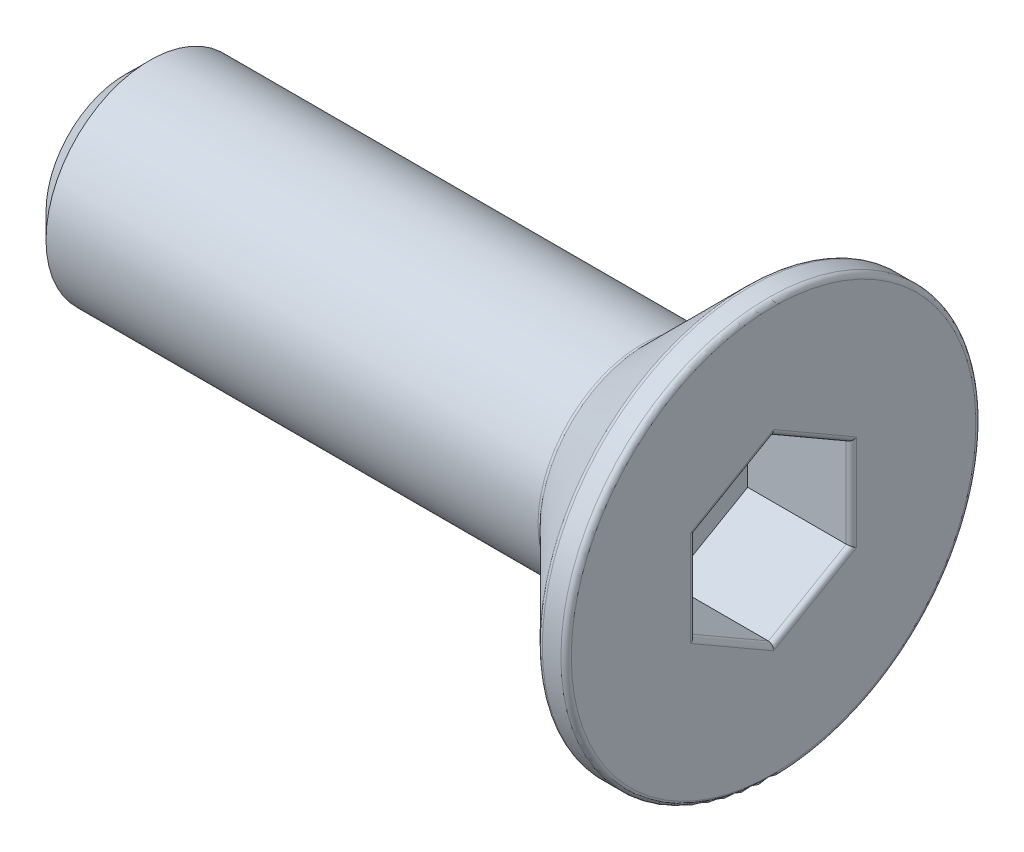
ISO-10303-21;
HEADER;
FILE_DESCRIPTION(('STEP AP214'),'2;1');
FILE_NAME('part.step','',(''),(''),'','','');
FILE_SCHEMA(('AUTOMOTIVE_DESIGN { 1 0 10303 214 1 1 1 1 }'));
ENDSEC;
DATA;
#1=APPLICATION_CONTEXT('core data for automotive mechanical design processes');
#2=APPLICATION_PROTOCOL_DEFINITION('international standard','automotive_design',2000,#1);
#3=PRODUCT_CONTEXT('',#1,'mechanical');
#4=PRODUCT('Part','Part','',(#3));
#5=PRODUCT_RELATED_PRODUCT_CATEGORY('part','',(#4));
#6=PRODUCT_DEFINITION_FORMATION('','',#4);
#7=PRODUCT_DEFINITION_CONTEXT('part definition',#1,'design');
#8=PRODUCT_DEFINITION('design','',#6,#7);
#9=PRODUCT_DEFINITION_SHAPE('','',#8);
#10=(LENGTH_UNIT() NAMED_UNIT(*) SI_UNIT(.MILLI.,.METRE.));
#11=(NAMED_UNIT(*) PLANE_ANGLE_UNIT() SI_UNIT($,.RADIAN.));
#12=(NAMED_UNIT(*) SI_UNIT($,.STERADIAN.) SOLID_ANGLE_UNIT());
#13=UNCERTAINTY_MEASURE_WITH_UNIT(LENGTH_MEASURE(1.E-05),#10,'distance_accuracy_value','');
#14=(GEOMETRIC_REPRESENTATION_CONTEXT(3) GLOBAL_UNCERTAINTY_ASSIGNED_CONTEXT((#13)) GLOBAL_UNIT_ASSIGNED_CONTEXT((#10,
#11,#12)) REPRESENTATION_CONTEXT('',''));
#15=CARTESIAN_POINT('',(0.,0.,0.));
#16=DIRECTION('',(0.,0.,1.));
#17=DIRECTION('',(1.,0.,0.));
#18=AXIS2_PLACEMENT_3D('',#15,#16,#17);
#19=CARTESIAN_POINT('',(0.,0.,0.));
#20=DIRECTION('',(-1.,0.,0.));
#21=DIRECTION('',(0.,0.,1.));
#22=AXIS2_PLACEMENT_3D('',#19,#20,#21);
#23=CYLINDRICAL_SURFACE('',#22,2.);
#24=CARTESIAN_POINT('',(13.9585786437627,0.,0.));
#25=DIRECTION('',(-1.,0.,0.));
#26=DIRECTION('',(0.,0.,1.));
#27=AXIS2_PLACEMENT_3D('',#24,#25,#26);
#28=CIRCLE('',#27,2.);
#29=CARTESIAN_POINT('',(13.9585786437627,0.,2.));
#30=VERTEX_POINT('',#29);
#31=EDGE_CURVE('E161',#30,#30,#28,.T.);
#32=ORIENTED_EDGE('',*,*,#31,.T.);
#33=EDGE_LOOP('',(#32));
#34=FACE_BOUND('',#33,.T.);
#35=CARTESIAN_POINT('',(4.47361785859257,0.,0.));
#36=DIRECTION('',(1.,0.,0.));
#37=DIRECTION('',(0.,0.,-1.));
#38=AXIS2_PLACEMENT_3D('',#35,#36,#37);
#39=CIRCLE('',#38,2.);
#40=CARTESIAN_POINT('',(4.47361785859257,0.,-2.));
#41=VERTEX_POINT('',#40);
#42=EDGE_CURVE('E123',#41,#41,#39,.F.);
#43=ORIENTED_EDGE('',*,*,#42,.F.);
#44=EDGE_LOOP('',(#43));
#45=FACE_BOUND('',#44,.T.);
#46=ADVANCED_FACE('F33',(#34,#45),#23,.T.);
#47=CARTESIAN_POINT('',(16.,0.,0.));
#48=DIRECTION('',(1.,0.,0.));
#49=DIRECTION('',(0.,0.,-1.));
#50=AXIS2_PLACEMENT_3D('',#47,#48,#49);
#51=CONICAL_SURFACE('',#50,4.,0.78539816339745);
#52=CARTESIAN_POINT('',(15.9707106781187,0.,0.));
#53=DIRECTION('',(-1.,0.,0.));
#54=DIRECTION('',(0.,0.,1.));
#55=AXIS2_PLACEMENT_3D('',#52,#53,#54);
#56=CIRCLE('',#55,3.97071067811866);
#57=CARTESIAN_POINT('',(15.9707106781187,0.,3.97071067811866));
#58=VERTEX_POINT('',#57);
#59=EDGE_CURVE('E152',#58,#58,#56,.T.);
#60=ORIENTED_EDGE('',*,*,#59,.T.);
#61=EDGE_LOOP('',(#60));
#62=FACE_BOUND('',#61,.T.);
#63=CARTESIAN_POINT('',(14.0292893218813,0.,0.));
#64=DIRECTION('',(1.,0.,0.));
#65=DIRECTION('',(0.,0.,-1.));
#66=AXIS2_PLACEMENT_3D('',#63,#64,#65);
#67=CIRCLE('',#66,2.02928932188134);
#68=CARTESIAN_POINT('',(14.0292893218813,0.,-2.02928932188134));
#69=VERTEX_POINT('',#68);
#70=EDGE_CURVE('E140',#69,#69,#67,.T.);
#71=ORIENTED_EDGE('',*,*,#70,.T.);
#72=EDGE_LOOP('',(#71));
#73=FACE_BOUND('',#72,.T.);
#74=ADVANCED_FACE('F240',(#62,#73),#51,.T.);
#75=CARTESIAN_POINT('',(0.,0.,0.));
#76=DIRECTION('',(-1.,0.,0.));
#77=DIRECTION('',(0.,0.,1.));
#78=AXIS2_PLACEMENT_3D('',#75,#76,#77);
#79=CYLINDRICAL_SURFACE('',#78,4.);
#80=CARTESIAN_POINT('',(16.0414213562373,0.,0.));
#81=DIRECTION('',(1.,0.,0.));
#82=DIRECTION('',(0.,0.,-1.));
#83=AXIS2_PLACEMENT_3D('',#80,#81,#82);
#84=CIRCLE('',#83,4.);
#85=CARTESIAN_POINT('',(16.0414213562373,0.,-4.));
#86=VERTEX_POINT('',#85);
#87=EDGE_CURVE('E158',#86,#86,#84,.T.);
#88=ORIENTED_EDGE('',*,*,#87,.T.);
#89=EDGE_LOOP('',(#88));
#90=FACE_BOUND('',#89,.T.);
#91=CARTESIAN_POINT('',(16.4,0.,0.));
#92=DIRECTION('',(-1.,0.,0.));
#93=DIRECTION('',(0.,0.,1.));
#94=AXIS2_PLACEMENT_3D('',#91,#92,#93);
#95=CIRCLE('',#94,4.);
#96=CARTESIAN_POINT('',(16.4,0.,4.));
#97=VERTEX_POINT('',#96);
#98=EDGE_CURVE('E155',#97,#97,#95,.T.);
#99=ORIENTED_EDGE('',*,*,#98,.T.);
#100=EDGE_LOOP('',(#99));
#101=FACE_BOUND('',#100,.T.);
#102=ADVANCED_FACE('F245',(#90,#101),#79,.T.);
#103=CARTESIAN_POINT('',(16.5,4.,0.));
#104=DIRECTION('',(-1.,0.,0.));
#105=DIRECTION('',(0.,0.,1.));
#106=AXIS2_PLACEMENT_3D('',#103,#104,#105);
#107=PLANE('',#106);
#108=CARTESIAN_POINT('',(16.5,0.,0.));
#109=DIRECTION('',(-1.,0.,0.));
#110=DIRECTION('',(0.,0.,1.));
#111=AXIS2_PLACEMENT_3D('',#108,#109,#110);
#112=CIRCLE('',#111,3.9);
#113=CARTESIAN_POINT('',(16.5,0.,3.9));
#114=VERTEX_POINT('',#113);
#115=EDGE_CURVE('E177',#114,#114,#112,.F.);
#116=ORIENTED_EDGE('',*,*,#115,.T.);
#117=EDGE_LOOP('',(#116));
#118=FACE_BOUND('',#117,.T.);
#119=DIRECTION('',(0.,0.5,0.866025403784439));
#120=VECTOR('',#119,1.);
#121=CARTESIAN_POINT('',(16.5,2.3856406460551,0.932050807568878));
#122=LINE('',#121,#120);
#123=CARTESIAN_POINT('',(16.5,1.8475208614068,0.));
#124=VERTEX_POINT('',#123);
#125=CARTESIAN_POINT('',(16.5,0.923760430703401,-1.6));
#126=VERTEX_POINT('',#125);
#127=EDGE_CURVE('E172',#124,#126,#122,.F.);
#128=ORIENTED_EDGE('',*,*,#127,.T.);
#129=DIRECTION('',(0.,1.,0.));
#130=VECTOR('',#129,1.);
#131=CARTESIAN_POINT('',(16.5,4.,-1.6));
#132=LINE('',#131,#130);
#133=CARTESIAN_POINT('',(16.5,-0.923760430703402,-1.6));
#134=VERTEX_POINT('',#133);
#135=EDGE_CURVE('E174',#126,#134,#132,.F.);
#136=ORIENTED_EDGE('',*,*,#135,.T.);
#137=DIRECTION('',(0.,0.5,-0.866025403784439));
#138=VECTOR('',#137,1.);
#139=CARTESIAN_POINT('',(16.5,-0.385640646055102,-2.53205080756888));
#140=LINE('',#139,#138);
#141=CARTESIAN_POINT('',(16.5,-1.8475208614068,0.));
#142=VERTEX_POINT('',#141);
#143=EDGE_CURVE('E164',#134,#142,#140,.F.);
#144=ORIENTED_EDGE('',*,*,#143,.T.);
#145=DIRECTION('',(0.,-0.5,-0.866025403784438));
#146=VECTOR('',#145,1.);
#147=CARTESIAN_POINT('',(16.5,-0.385640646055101,2.53205080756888));
#148=LINE('',#147,#146);
#149=CARTESIAN_POINT('',(16.5,-0.923760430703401,1.6));
#150=VERTEX_POINT('',#149);
#151=EDGE_CURVE('E166',#142,#150,#148,.F.);
#152=ORIENTED_EDGE('',*,*,#151,.T.);
#153=DIRECTION('',(0.,-1.,0.));
#154=VECTOR('',#153,1.);
#155=CARTESIAN_POINT('',(16.5,4.,1.6));
#156=LINE('',#155,#154);
#157=CARTESIAN_POINT('',(16.5,0.923760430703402,1.6));
#158=VERTEX_POINT('',#157);
#159=EDGE_CURVE('E168',#150,#158,#156,.F.);
#160=ORIENTED_EDGE('',*,*,#159,.T.);
#161=DIRECTION('',(0.,-0.5,0.866025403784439));
#162=VECTOR('',#161,1.);
#163=CARTESIAN_POINT('',(16.5,2.3856406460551,-0.932050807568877));
#164=LINE('',#163,#162);
#165=EDGE_CURVE('E170',#158,#124,#164,.F.);
#166=ORIENTED_EDGE('',*,*,#165,.T.);
#167=EDGE_LOOP('',(#128,#136,#144,#152,#160,#166));
#168=FACE_BOUND('',#167,.T.);
#169=ADVANCED_FACE('F272',(#118,#168),#107,.F.);
#170=CARTESIAN_POINT('',(14.5,-0.866025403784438,1.5));
#171=DIRECTION('',(0.,-0.866025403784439,0.5));
#172=DIRECTION('',(0.,-0.5,-0.866025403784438));
#173=AXIS2_PLACEMENT_3D('',#170,#171,#172);
#174=PLANE('',#173);
#175=DIRECTION('',(1.,0.,0.));
#176=VECTOR('',#175,1.);
#177=CARTESIAN_POINT('',(14.5,-0.866025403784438,1.5));
#178=LINE('',#177,#176);
#179=CARTESIAN_POINT('',(14.5,-0.866025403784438,1.5));
#180=VERTEX_POINT('',#179);
#181=CARTESIAN_POINT('',(16.4,-0.866025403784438,1.5));
#182=VERTEX_POINT('',#181);
#183=EDGE_CURVE('E138',#180,#182,#178,.T.);
#184=ORIENTED_EDGE('',*,*,#183,.T.);
#185=DIRECTION('',(0.,-0.5,-0.866025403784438));
#186=VECTOR('',#185,1.);
#187=CARTESIAN_POINT('',(16.4,-0.866025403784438,1.5));
#188=LINE('',#187,#186);
#189=CARTESIAN_POINT('',(16.4,-1.73205080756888,0.));
#190=VERTEX_POINT('',#189);
#191=EDGE_CURVE('E40',#182,#190,#188,.T.);
#192=ORIENTED_EDGE('',*,*,#191,.T.);
#193=DIRECTION('',(1.,0.,0.));
#194=VECTOR('',#193,1.);
#195=CARTESIAN_POINT('',(14.5,-1.73205080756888,0.));
#196=LINE('',#195,#194);
#197=CARTESIAN_POINT('',(14.5,-1.73205080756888,0.));
#198=VERTEX_POINT('',#197);
#199=EDGE_CURVE('E100',#198,#190,#196,.T.);
#200=ORIENTED_EDGE('',*,*,#199,.F.);
#201=DIRECTION('',(0.,-0.5,-0.866025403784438));
#202=VECTOR('',#201,1.);
#203=CARTESIAN_POINT('',(14.5,-0.866025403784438,1.5));
#204=LINE('',#203,#202);
#205=EDGE_CURVE('E104',#180,#198,#204,.T.);
#206=ORIENTED_EDGE('',*,*,#205,.F.);
#207=EDGE_LOOP('',(#184,#192,#200,#206));
#208=FACE_BOUND('',#207,.T.);
#209=ADVANCED_FACE('F102',(#208),#174,.F.);
#210=CARTESIAN_POINT('',(14.5,0.866025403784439,1.5));
#211=DIRECTION('',(0.,0.,1.));
#212=DIRECTION('',(1.,0.,0.));
#213=AXIS2_PLACEMENT_3D('',#210,#211,#212);
#214=PLANE('',#213);
#215=DIRECTION('',(1.,0.,0.));
#216=VECTOR('',#215,1.);
#217=CARTESIAN_POINT('',(14.5,0.866025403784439,1.5));
#218=LINE('',#217,#216);
#219=CARTESIAN_POINT('',(14.5,0.866025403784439,1.5));
#220=VERTEX_POINT('',#219);
#221=CARTESIAN_POINT('',(16.4,0.866025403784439,1.5));
#222=VERTEX_POINT('',#221);
#223=EDGE_CURVE('E141',#220,#222,#218,.T.);
#224=ORIENTED_EDGE('',*,*,#223,.T.);
#225=DIRECTION('',(0.,-1.,0.));
#226=VECTOR('',#225,1.);
#227=CARTESIAN_POINT('',(16.4,0.866025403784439,1.5));
#228=LINE('',#227,#226);
#229=EDGE_CURVE('E54',#222,#182,#228,.T.);
#230=ORIENTED_EDGE('',*,*,#229,.T.);
#231=ORIENTED_EDGE('',*,*,#183,.F.);
#232=DIRECTION('',(0.,-1.,0.));
#233=VECTOR('',#232,1.);
#234=CARTESIAN_POINT('',(14.5,0.866025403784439,1.5));
#235=LINE('',#234,#233);
#236=EDGE_CURVE('E109',#220,#180,#235,.T.);
#237=ORIENTED_EDGE('',*,*,#236,.F.);
#238=EDGE_LOOP('',(#224,#230,#231,#237));
#239=FACE_BOUND('',#238,.T.);
#240=ADVANCED_FACE('F195',(#239),#214,.F.);
#241=CARTESIAN_POINT('',(14.5,1.73205080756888,0.));
#242=DIRECTION('',(0.,0.866025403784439,0.5));
#243=DIRECTION('',(0.,-0.5,0.866025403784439));
#244=AXIS2_PLACEMENT_3D('',#241,#242,#243);
#245=PLANE('',#244);
#246=DIRECTION('',(1.,0.,0.));
#247=VECTOR('',#246,1.);
#248=CARTESIAN_POINT('',(14.5,1.73205080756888,0.));
#249=LINE('',#248,#247);
#250=CARTESIAN_POINT('',(14.5,1.73205080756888,0.));
#251=VERTEX_POINT('',#250);
#252=CARTESIAN_POINT('',(16.4,1.73205080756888,0.));
#253=VERTEX_POINT('',#252);
#254=EDGE_CURVE('E143',#251,#253,#249,.T.);
#255=ORIENTED_EDGE('',*,*,#254,.T.);
#256=DIRECTION('',(0.,-0.5,0.866025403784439));
#257=VECTOR('',#256,1.);
#258=CARTESIAN_POINT('',(16.4,1.73205080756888,0.));
#259=LINE('',#258,#257);
#260=EDGE_CURVE('E185',#253,#222,#259,.T.);
#261=ORIENTED_EDGE('',*,*,#260,.T.);
#262=ORIENTED_EDGE('',*,*,#223,.F.);
#263=DIRECTION('',(0.,-0.5,0.866025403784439));
#264=VECTOR('',#263,1.);
#265=CARTESIAN_POINT('',(14.5,1.73205080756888,0.));
#266=LINE('',#265,#264);
#267=EDGE_CURVE('E135',#251,#220,#266,.T.);
#268=ORIENTED_EDGE('',*,*,#267,.F.);
#269=EDGE_LOOP('',(#255,#261,#262,#268));
#270=FACE_BOUND('',#269,.T.);
#271=ADVANCED_FACE('F189',(#270),#245,.F.);
#272=CARTESIAN_POINT('',(14.5,0.866025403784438,-1.5));
#273=DIRECTION('',(0.,0.866025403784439,-0.5));
#274=DIRECTION('',(0.,0.5,0.866025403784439));
#275=AXIS2_PLACEMENT_3D('',#272,#273,#274);
#276=PLANE('',#275);
#277=DIRECTION('',(1.,0.,0.));
#278=VECTOR('',#277,1.);
#279=CARTESIAN_POINT('',(14.5,0.866025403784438,-1.5));
#280=LINE('',#279,#278);
#281=CARTESIAN_POINT('',(14.5,0.866025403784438,-1.5));
#282=VERTEX_POINT('',#281);
#283=CARTESIAN_POINT('',(16.4,0.866025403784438,-1.5));
#284=VERTEX_POINT('',#283);
#285=EDGE_CURVE('E146',#282,#284,#280,.T.);
#286=ORIENTED_EDGE('',*,*,#285,.T.);
#287=DIRECTION('',(0.,0.5,0.866025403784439));
#288=VECTOR('',#287,1.);
#289=CARTESIAN_POINT('',(16.4,0.866025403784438,-1.5));
#290=LINE('',#289,#288);
#291=EDGE_CURVE('E183',#284,#253,#290,.T.);
#292=ORIENTED_EDGE('',*,*,#291,.T.);
#293=ORIENTED_EDGE('',*,*,#254,.F.);
#294=DIRECTION('',(0.,0.5,0.866025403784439));
#295=VECTOR('',#294,1.);
#296=CARTESIAN_POINT('',(14.5,0.866025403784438,-1.5));
#297=LINE('',#296,#295);
#298=EDGE_CURVE('E132',#282,#251,#297,.T.);
#299=ORIENTED_EDGE('',*,*,#298,.F.);
#300=EDGE_LOOP('',(#286,#292,#293,#299));
#301=FACE_BOUND('',#300,.T.);
#302=ADVANCED_FACE('F230',(#301),#276,.F.);
#303=CARTESIAN_POINT('',(14.5,-0.866025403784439,-1.5));
#304=DIRECTION('',(0.,0.,-1.));
#305=DIRECTION('',(0.,1.,0.));
#306=AXIS2_PLACEMENT_3D('',#303,#304,#305);
#307=PLANE('',#306);
#308=DIRECTION('',(1.,0.,0.));
#309=VECTOR('',#308,1.);
#310=CARTESIAN_POINT('',(14.5,-0.866025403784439,-1.5));
#311=LINE('',#310,#309);
#312=CARTESIAN_POINT('',(14.5,-0.866025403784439,-1.5));
#313=VERTEX_POINT('',#312);
#314=CARTESIAN_POINT('',(16.4,-0.866025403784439,-1.5));
#315=VERTEX_POINT('',#314);
#316=EDGE_CURVE('E108',#313,#315,#311,.T.);
#317=ORIENTED_EDGE('',*,*,#316,.T.);
#318=DIRECTION('',(0.,1.,0.));
#319=VECTOR('',#318,1.);
#320=CARTESIAN_POINT('',(16.4,-0.866025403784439,-1.5));
#321=LINE('',#320,#319);
#322=EDGE_CURVE('E180',#315,#284,#321,.T.);
#323=ORIENTED_EDGE('',*,*,#322,.T.);
#324=ORIENTED_EDGE('',*,*,#285,.F.);
#325=DIRECTION('',(0.,1.,0.));
#326=VECTOR('',#325,1.);
#327=CARTESIAN_POINT('',(14.5,-0.866025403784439,-1.5));
#328=LINE('',#327,#326);
#329=EDGE_CURVE('E118',#313,#282,#328,.T.);
#330=ORIENTED_EDGE('',*,*,#329,.F.);
#331=EDGE_LOOP('',(#317,#323,#324,#330));
#332=FACE_BOUND('',#331,.T.);
#333=ADVANCED_FACE('F227',(#332),#307,.F.);
#334=CARTESIAN_POINT('',(14.5,-1.73205080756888,0.));
#335=DIRECTION('',(0.,-0.866025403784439,-0.5));
#336=DIRECTION('',(0.,0.5,-0.866025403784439));
#337=AXIS2_PLACEMENT_3D('',#334,#335,#336);
#338=PLANE('',#337);
#339=ORIENTED_EDGE('',*,*,#199,.T.);
#340=DIRECTION('',(0.,0.5,-0.866025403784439));
#341=VECTOR('',#340,1.);
#342=CARTESIAN_POINT('',(16.4,-1.73205080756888,0.));
#343=LINE('',#342,#341);
#344=EDGE_CURVE('E11',#190,#315,#343,.T.);
#345=ORIENTED_EDGE('',*,*,#344,.T.);
#346=ORIENTED_EDGE('',*,*,#316,.F.);
#347=DIRECTION('',(0.,0.5,-0.866025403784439));
#348=VECTOR('',#347,1.);
#349=CARTESIAN_POINT('',(14.5,-1.73205080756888,0.));
#350=LINE('',#349,#348);
#351=EDGE_CURVE('E112',#198,#313,#350,.T.);
#352=ORIENTED_EDGE('',*,*,#351,.F.);
#353=EDGE_LOOP('',(#339,#345,#346,#352));
#354=FACE_BOUND('',#353,.T.);
#355=ADVANCED_FACE('F113',(#354),#338,.F.);
#356=CARTESIAN_POINT('',(14.5,-1.73205080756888,0.));
#357=DIRECTION('',(1.,0.,0.));
#358=DIRECTION('',(0.,0.,-1.));
#359=AXIS2_PLACEMENT_3D('',#356,#357,#358);
#360=PLANE('',#359);
#361=ORIENTED_EDGE('',*,*,#205,.T.);
#362=ORIENTED_EDGE('',*,*,#351,.T.);
#363=ORIENTED_EDGE('',*,*,#329,.T.);
#364=ORIENTED_EDGE('',*,*,#298,.T.);
#365=ORIENTED_EDGE('',*,*,#267,.T.);
#366=ORIENTED_EDGE('',*,*,#236,.T.);
#367=EDGE_LOOP('',(#361,#362,#363,#364,#365,#366));
#368=FACE_BOUND('',#367,.T.);
#369=ADVANCED_FACE('F120',(#368),#360,.T.);
#370=CARTESIAN_POINT('',(4.,0.,0.));
#371=DIRECTION('',(1.,0.,0.));
#372=DIRECTION('',(0.,0.,-1.));
#373=AXIS2_PLACEMENT_3D('',#370,#371,#372);
#374=CONICAL_SURFACE('',#373,1.52638214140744,0.785398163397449);
#375=CARTESIAN_POINT('',(4.,0.,0.));
#376=DIRECTION('',(-1.,0.,0.));
#377=DIRECTION('',(0.,0.,1.));
#378=AXIS2_PLACEMENT_3D('',#375,#376,#377);
#379=CIRCLE('',#378,1.52638214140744);
#380=CARTESIAN_POINT('',(4.,0.,1.52638214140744));
#381=VERTEX_POINT('',#380);
#382=EDGE_CURVE('E126',#381,#381,#379,.T.);
#383=ORIENTED_EDGE('',*,*,#382,.F.);
#384=EDGE_LOOP('',(#383));
#385=FACE_BOUND('',#384,.T.);
#386=ORIENTED_EDGE('',*,*,#42,.T.);
#387=EDGE_LOOP('',(#386));
#388=FACE_BOUND('',#387,.T.);
#389=ADVANCED_FACE('F251',(#385,#388),#374,.T.);
#390=CARTESIAN_POINT('',(4.,1.52638214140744,0.));
#391=DIRECTION('',(-1.,0.,0.));
#392=DIRECTION('',(0.,0.,1.));
#393=AXIS2_PLACEMENT_3D('',#390,#391,#392);
#394=PLANE('',#393);
#395=ORIENTED_EDGE('',*,*,#382,.T.);
#396=EDGE_LOOP('',(#395));
#397=FACE_BOUND('',#396,.T.);
#398=ADVANCED_FACE('F253',(#397),#394,.T.);
#399=CARTESIAN_POINT('',(16.0414213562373,0.,0.));
#400=DIRECTION('',(1.,0.,0.));
#401=DIRECTION('',(0.,0.,-1.));
#402=AXIS2_PLACEMENT_3D('',#399,#400,#401);
#403=TOROIDAL_SURFACE('',#402,3.9,0.1);
#404=ORIENTED_EDGE('',*,*,#87,.F.);
#405=EDGE_LOOP('',(#404));
#406=FACE_BOUND('',#405,.T.);
#407=ORIENTED_EDGE('',*,*,#59,.F.);
#408=EDGE_LOOP('',(#407));
#409=FACE_BOUND('',#408,.T.);
#410=ADVANCED_FACE('F260',(#406,#409),#403,.T.);
#411=CARTESIAN_POINT('',(13.9585786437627,0.,0.));
#412=DIRECTION('',(-1.,0.,0.));
#413=DIRECTION('',(0.,0.,1.));
#414=AXIS2_PLACEMENT_3D('',#411,#412,#413);
#415=TOROIDAL_SURFACE('',#414,2.1,0.1);
#416=ORIENTED_EDGE('',*,*,#70,.F.);
#417=EDGE_LOOP('',(#416));
#418=FACE_BOUND('',#417,.T.);
#419=ORIENTED_EDGE('',*,*,#31,.F.);
#420=EDGE_LOOP('',(#419));
#421=FACE_BOUND('',#420,.T.);
#422=ADVANCED_FACE('F291',(#418,#421),#415,.F.);
#423=CARTESIAN_POINT('',(16.4,0.,0.));
#424=DIRECTION('',(-1.,0.,0.));
#425=DIRECTION('',(0.,0.,1.));
#426=AXIS2_PLACEMENT_3D('',#423,#424,#425);
#427=TOROIDAL_SURFACE('',#426,3.9,0.1);
#428=ORIENTED_EDGE('',*,*,#115,.F.);
#429=EDGE_LOOP('',(#428));
#430=FACE_BOUND('',#429,.T.);
#431=ORIENTED_EDGE('',*,*,#98,.F.);
#432=EDGE_LOOP('',(#431));
#433=FACE_BOUND('',#432,.T.);
#434=ADVANCED_FACE('F289',(#430,#433),#427,.T.);
#435=CARTESIAN_POINT('',(16.4,0.866025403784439,1.6));
#436=DIRECTION('',(0.,-1.,0.));
#437=DIRECTION('',(0.,0.,-1.));
#438=AXIS2_PLACEMENT_3D('',#435,#436,#437);
#439=CYLINDRICAL_SURFACE('',#438,0.1);
#440=CARTESIAN_POINT('',(16.4,0.923760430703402,1.6));
#441=DIRECTION('',(0.,-0.866025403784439,0.5));
#442=DIRECTION('',(0.,0.5,0.866025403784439));
#443=AXIS2_PLACEMENT_3D('',#440,#441,#442);
#444=ELLIPSE('',#443,0.115470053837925,0.1);
#445=EDGE_CURVE('E201',#158,#222,#444,.F.);
#446=ORIENTED_EDGE('',*,*,#445,.F.);
#447=ORIENTED_EDGE('',*,*,#159,.F.);
#448=CARTESIAN_POINT('',(16.4,-0.923760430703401,1.6));
#449=DIRECTION('',(0.,-0.866025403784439,-0.5));
#450=DIRECTION('',(0.,-0.5,0.866025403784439));
#451=AXIS2_PLACEMENT_3D('',#448,#449,#450);
#452=ELLIPSE('',#451,0.115470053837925,0.1);
#453=EDGE_CURVE('E204',#182,#150,#452,.T.);
#454=ORIENTED_EDGE('',*,*,#453,.F.);
#455=ORIENTED_EDGE('',*,*,#229,.F.);
#456=EDGE_LOOP('',(#446,#447,#454,#455));
#457=FACE_BOUND('',#456,.T.);
#458=ADVANCED_FACE('F199',(#457),#439,.T.);
#459=CARTESIAN_POINT('',(16.4,-0.952627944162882,1.55));
#460=DIRECTION('',(0.,-0.5,-0.866025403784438));
#461=DIRECTION('',(0.,0.866025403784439,-0.5));
#462=AXIS2_PLACEMENT_3D('',#459,#460,#461);
#463=CYLINDRICAL_SURFACE('',#462,0.1);
#464=ORIENTED_EDGE('',*,*,#453,.T.);
#465=ORIENTED_EDGE('',*,*,#151,.F.);
#466=CARTESIAN_POINT('',(16.4,-1.8475208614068,0.));
#467=DIRECTION('',(0.,0.,-1.));
#468=DIRECTION('',(0.,-1.,0.));
#469=AXIS2_PLACEMENT_3D('',#466,#467,#468);
#470=ELLIPSE('',#469,0.115470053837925,0.1);
#471=EDGE_CURVE('E206',#190,#142,#470,.T.);
#472=ORIENTED_EDGE('',*,*,#471,.F.);
#473=ORIENTED_EDGE('',*,*,#191,.F.);
#474=EDGE_LOOP('',(#464,#465,#472,#473));
#475=FACE_BOUND('',#474,.T.);
#476=ADVANCED_FACE('F298',(#475),#463,.T.);
#477=CARTESIAN_POINT('',(16.4,1.81865334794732,0.0500000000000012));
#478=DIRECTION('',(0.,-0.5,0.866025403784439));
#479=DIRECTION('',(0.,-0.866025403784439,-0.5));
#480=AXIS2_PLACEMENT_3D('',#477,#478,#479);
#481=CYLINDRICAL_SURFACE('',#480,0.1);
#482=ORIENTED_EDGE('',*,*,#445,.T.);
#483=ORIENTED_EDGE('',*,*,#260,.F.);
#484=CARTESIAN_POINT('',(16.4,1.8475208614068,0.));
#485=DIRECTION('',(0.,0.,1.));
#486=DIRECTION('',(0.,1.,0.));
#487=AXIS2_PLACEMENT_3D('',#484,#485,#486);
#488=ELLIPSE('',#487,0.115470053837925,0.1);
#489=EDGE_CURVE('E209',#124,#253,#488,.F.);
#490=ORIENTED_EDGE('',*,*,#489,.F.);
#491=ORIENTED_EDGE('',*,*,#165,.F.);
#492=EDGE_LOOP('',(#482,#483,#490,#491));
#493=FACE_BOUND('',#492,.T.);
#494=ADVANCED_FACE('F205',(#493),#481,.T.);
#495=CARTESIAN_POINT('',(16.4,-1.81865334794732,-0.0499999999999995));
#496=DIRECTION('',(0.,0.5,-0.866025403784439));
#497=DIRECTION('',(0.,0.866025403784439,0.5));
#498=AXIS2_PLACEMENT_3D('',#495,#496,#497);
#499=CYLINDRICAL_SURFACE('',#498,0.1);
#500=ORIENTED_EDGE('',*,*,#471,.T.);
#501=ORIENTED_EDGE('',*,*,#143,.F.);
#502=CARTESIAN_POINT('',(16.4,-0.923760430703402,-1.6));
#503=DIRECTION('',(0.,0.866025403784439,-0.5));
#504=DIRECTION('',(0.,0.5,0.866025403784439));
#505=AXIS2_PLACEMENT_3D('',#502,#503,#504);
#506=ELLIPSE('',#505,0.115470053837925,0.1);
#507=EDGE_CURVE('E213',#315,#134,#506,.T.);
#508=ORIENTED_EDGE('',*,*,#507,.F.);
#509=ORIENTED_EDGE('',*,*,#344,.F.);
#510=EDGE_LOOP('',(#500,#501,#508,#509));
#511=FACE_BOUND('',#510,.T.);
#512=ADVANCED_FACE('F308',(#511),#499,.T.);
#513=CARTESIAN_POINT('',(16.4,0.952627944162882,-1.55));
#514=DIRECTION('',(0.,0.5,0.866025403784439));
#515=DIRECTION('',(0.,-0.866025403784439,0.5));
#516=AXIS2_PLACEMENT_3D('',#513,#514,#515);
#517=CYLINDRICAL_SURFACE('',#516,0.1);
#518=ORIENTED_EDGE('',*,*,#489,.T.);
#519=ORIENTED_EDGE('',*,*,#291,.F.);
#520=CARTESIAN_POINT('',(16.4,0.923760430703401,-1.6));
#521=DIRECTION('',(0.,0.866025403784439,0.5));
#522=DIRECTION('',(0.,0.5,-0.866025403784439));
#523=AXIS2_PLACEMENT_3D('',#520,#521,#522);
#524=ELLIPSE('',#523,0.115470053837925,0.1);
#525=EDGE_CURVE('E215',#126,#284,#524,.F.);
#526=ORIENTED_EDGE('',*,*,#525,.F.);
#527=ORIENTED_EDGE('',*,*,#127,.F.);
#528=EDGE_LOOP('',(#518,#519,#526,#527));
#529=FACE_BOUND('',#528,.T.);
#530=ADVANCED_FACE('F224',(#529),#517,.T.);
#531=CARTESIAN_POINT('',(16.4,-0.866025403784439,-1.6));
#532=DIRECTION('',(0.,1.,0.));
#533=DIRECTION('',(0.,0.,1.));
#534=AXIS2_PLACEMENT_3D('',#531,#532,#533);
#535=CYLINDRICAL_SURFACE('',#534,0.1);
#536=ORIENTED_EDGE('',*,*,#507,.T.);
#537=ORIENTED_EDGE('',*,*,#135,.F.);
#538=ORIENTED_EDGE('',*,*,#525,.T.);
#539=ORIENTED_EDGE('',*,*,#322,.F.);
#540=EDGE_LOOP('',(#536,#537,#538,#539));
#541=FACE_BOUND('',#540,.T.);
#542=ADVANCED_FACE('F221',(#541),#535,.T.);
#543=CLOSED_SHELL('',(#46,#74,#102,#169,#209,#240,#271,#302,#333,#355,#369,#389,#398,#410,#422,
#434,#458,#476,#494,#512,#530,#542));
#544=MANIFOLD_SOLID_BREP('B2',#543);
#545=ADVANCED_BREP_SHAPE_REPRESENTATION('',(#18,#544),#14);
#546=SHAPE_DEFINITION_REPRESENTATION(#9,#545);
ENDSEC;
END-ISO-10303-21;
